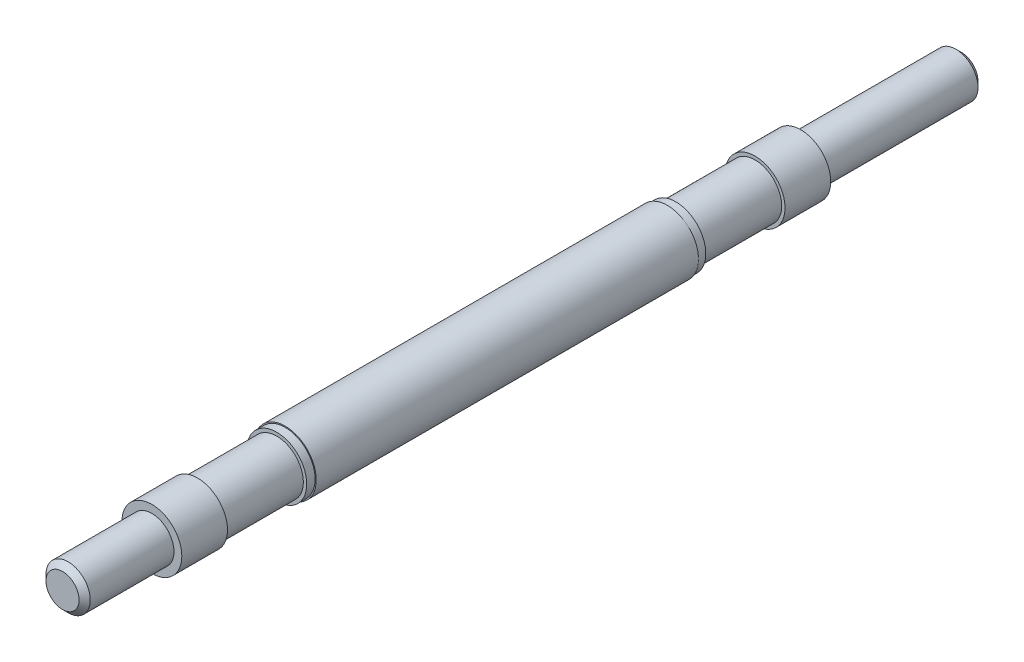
from build123d import *

# Parameters (mm, degrees)
ESQUISSE1_R                   = 11.1
MATIERE_DE_DEPART_DEPTH       = 160.5
ESQUISSE2_R                   = 11.1
ESQUISSE2_R_2                 = 10.7
CHARIOTAGE_D21_40_79_50_DEPTH = 79.5
CHARIOTAGE_START              = -105
ESQUISSE3_R                   = 11.1
ESQUISSE3_R_2                 = 10.7
CHARIOTAGE_D21_40_105_DEPTH   = 105
ESQUISSE4_R                   = 10.7
ESQUISSE4_R_2                 = 7.9
CHARIOTAGE_D15_80_31_90_DEPTH = 31.9
CHARIOTAGE_START_2            = -57.4
ESQUISSE5_R                   = 10.7
ESQUISSE5_R_2                 = 7.9
CHARIOTAGE_D15_80_57_40_DEPTH = 57.4
CHANFREIN_2_45_SIZE           = 2
ESQUISSE6_R                   = 10.7
ESQUISSE6_R_2                 = 9.5
CHARIOTAGE_D19_28_30_DEPTH    = 28.3
CHARIOTAGE_START_3            = -28.3
ESQUISSE7_R                   = 10.7
ESQUISSE7_R_2                 = 9.5
CHARIOTAGE_D19_28_30_2_DEPTH  = 28.3


with BuildPart() as part:
    # Esquisse1 → Matiere de depart (new, symmetric)
    with BuildSketch(Plane.XY):
        Circle(ESQUISSE1_R)
    extrude(amount=MATIERE_DE_DEPART_DEPTH, both=True)

    # Esquisse2 → Chariotage D21.40_79.50 (cut)
    with BuildSketch(Plane.XY.offset(160.5)):
        Circle(ESQUISSE2_R)
        Circle(ESQUISSE2_R_2, mode=Mode.SUBTRACT)
    extrude(amount=-CHARIOTAGE_D21_40_79_50_DEPTH, mode=Mode.SUBTRACT)

    # Esquisse3 → Chariotage D21.40_105 (cut)
    with BuildSketch(Plane(origin=(0, 0, -160.5), x_dir=(-1, 0, 0), z_dir=(0, 0, -1)).offset(CHARIOTAGE_START)):
        Circle(ESQUISSE3_R)
        with Locations(Location((0, 0, 0), (0, 0, 180))):
            Circle(ESQUISSE3_R_2, mode=Mode.SUBTRACT)
    extrude(amount=CHARIOTAGE_D21_40_105_DEPTH, mode=Mode.SUBTRACT)

    # Esquisse4 → Chariotage D15.80_31.90 (cut)
    with BuildSketch(Plane.XY.offset(160.5)):
        Circle(ESQUISSE4_R)
        Circle(ESQUISSE4_R_2, mode=Mode.SUBTRACT)
    extrude(amount=-CHARIOTAGE_D15_80_31_90_DEPTH, mode=Mode.SUBTRACT)

    # Esquisse5 → Chariotage D15.80_57.40 (cut)
    with BuildSketch(Plane(origin=(0, 0, -160.5), x_dir=(-1, 0, 0), z_dir=(0, 0, -1)).offset(CHARIOTAGE_START_2)):
        Circle(ESQUISSE5_R)
        with Locations(Location((0, 0, 0), (0, 0, 180))):
            Circle(ESQUISSE5_R_2, mode=Mode.SUBTRACT)
    extrude(amount=CHARIOTAGE_D15_80_57_40_DEPTH, mode=Mode.SUBTRACT)

    # Chanfrein 2_45
    chanfrein_2_45_edges = [part.edges().sort_by_distance(p)[0] for p in [
        (-7.9, 0, 160.5),
        (-7.9, 0, -160.5),
    ]]
    chamfer(chanfrein_2_45_edges, length=CHANFREIN_2_45_SIZE)

    # Esquisse6 → Chariotage D19_28.30 (cut)
    with BuildSketch(Plane.XY.offset(112.3)):
        Circle(ESQUISSE6_R)
        Circle(ESQUISSE6_R_2, mode=Mode.SUBTRACT)
    extrude(amount=-CHARIOTAGE_D19_28_30_DEPTH, mode=Mode.SUBTRACT)

    # Esquisse7 → Chariotage D19_28.30 2 (cut)
    with BuildSketch(Plane(origin=(0, 0, -86.8), x_dir=(-1, 0, 0), z_dir=(0, 0, -1)).offset(CHARIOTAGE_START_3)):
        Circle(ESQUISSE7_R)
        with Locations(Location((0, 0, 0), (0, 0, 180))):
            Circle(ESQUISSE7_R_2, mode=Mode.SUBTRACT)
    extrude(amount=CHARIOTAGE_D19_28_30_2_DEPTH, mode=Mode.SUBTRACT)


solid = part.part
